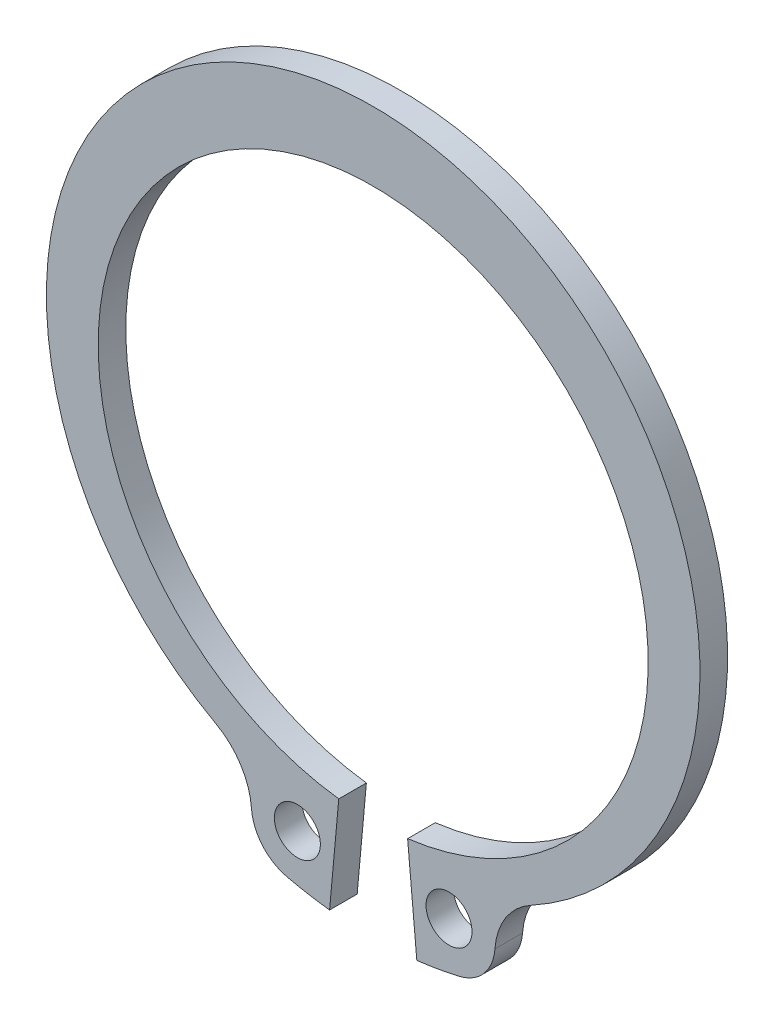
ISO-10303-21;
HEADER;
FILE_DESCRIPTION(('STEP AP214'),'2;1');
FILE_NAME('part.step','',(''),(''),'','','');
FILE_SCHEMA(('AUTOMOTIVE_DESIGN { 1 0 10303 214 1 1 1 1 }'));
ENDSEC;
DATA;
#1=APPLICATION_CONTEXT('core data for automotive mechanical design processes');
#2=APPLICATION_PROTOCOL_DEFINITION('international standard','automotive_design',2000,#1);
#3=PRODUCT_CONTEXT('',#1,'mechanical');
#4=PRODUCT('Part','Part','',(#3));
#5=PRODUCT_RELATED_PRODUCT_CATEGORY('part','',(#4));
#6=PRODUCT_DEFINITION_FORMATION('','',#4);
#7=PRODUCT_DEFINITION_CONTEXT('part definition',#1,'design');
#8=PRODUCT_DEFINITION('design','',#6,#7);
#9=PRODUCT_DEFINITION_SHAPE('','',#8);
#10=(LENGTH_UNIT() NAMED_UNIT(*) SI_UNIT(.MILLI.,.METRE.));
#11=(NAMED_UNIT(*) PLANE_ANGLE_UNIT() SI_UNIT($,.RADIAN.));
#12=(NAMED_UNIT(*) SI_UNIT($,.STERADIAN.) SOLID_ANGLE_UNIT());
#13=UNCERTAINTY_MEASURE_WITH_UNIT(LENGTH_MEASURE(1.E-05),#10,'distance_accuracy_value','');
#14=(GEOMETRIC_REPRESENTATION_CONTEXT(3) GLOBAL_UNCERTAINTY_ASSIGNED_CONTEXT((#13)) GLOBAL_UNIT_ASSIGNED_CONTEXT((#10,
#11,#12)) REPRESENTATION_CONTEXT('',''));
#15=CARTESIAN_POINT('',(0.,0.,0.));
#16=DIRECTION('',(0.,0.,1.));
#17=DIRECTION('',(1.,0.,0.));
#18=AXIS2_PLACEMENT_3D('',#15,#16,#17);
#19=CARTESIAN_POINT('',(0.,0.,1.2));
#20=DIRECTION('',(0.,0.,1.));
#21=DIRECTION('',(1.,0.,0.));
#22=AXIS2_PLACEMENT_3D('',#19,#20,#21);
#23=PLANE('',#22);
#24=CARTESIAN_POINT('',(-3.29477642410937,-13.9646718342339,1.2));
#25=DIRECTION('',(0.,0.,1.));
#26=DIRECTION('',(-1.,0.,0.));
#27=AXIS2_PLACEMENT_3D('',#24,#25,#26);
#28=CIRCLE('',#27,1.);
#29=CARTESIAN_POINT('',(-4.29477642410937,-13.9646718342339,1.2));
#30=VERTEX_POINT('',#29);
#31=EDGE_CURVE('E144',#30,#30,#28,.T.);
#32=ORIENTED_EDGE('',*,*,#31,.F.);
#33=EDGE_LOOP('',(#32));
#34=FACE_BOUND('',#33,.T.);
#35=CARTESIAN_POINT('',(0.,0.,1.2));
#36=DIRECTION('',(0.,0.,-1.));
#37=DIRECTION('',(1.,0.,0.));
#38=AXIS2_PLACEMENT_3D('',#35,#36,#37);
#39=CIRCLE('',#38,11.95);
#40=CARTESIAN_POINT('',(-1.49570369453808,-11.8560267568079,1.2));
#41=VERTEX_POINT('',#40);
#42=CARTESIAN_POINT('',(1.49570369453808,-11.8560267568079,1.2));
#43=VERTEX_POINT('',#42);
#44=EDGE_CURVE('E159',#41,#43,#39,.T.);
#45=ORIENTED_EDGE('',*,*,#44,.T.);
#46=DIRECTION('',(0.0908774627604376,-0.99586208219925,0.));
#47=VECTOR('',#46,1.);
#48=CARTESIAN_POINT('',(1.49570369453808,-11.8560267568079,1.2));
#49=LINE('',#48,#47);
#50=CARTESIAN_POINT('',(1.895564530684,-16.2378199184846,1.2));
#51=VERTEX_POINT('',#50);
#52=EDGE_CURVE('E97',#43,#51,#49,.T.);
#53=ORIENTED_EDGE('',*,*,#52,.T.);
#54=CARTESIAN_POINT('',(0.,0.,1.2));
#55=DIRECTION('',(0.,0.,1.));
#56=DIRECTION('',(1.,0.,0.));
#57=AXIS2_PLACEMENT_3D('',#54,#55,#56);
#58=CIRCLE('',#57,16.3480873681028);
#59=CARTESIAN_POINT('',(3.75403992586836,-15.9112270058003,1.2));
#60=VERTEX_POINT('',#59);
#61=EDGE_CURVE('E180',#51,#60,#58,.T.);
#62=ORIENTED_EDGE('',*,*,#61,.T.);
#63=CARTESIAN_POINT('',(3.29477642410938,-13.9646718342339,1.2));
#64=DIRECTION('',(0.,0.,1.));
#65=DIRECTION('',(1.,0.,0.));
#66=AXIS2_PLACEMENT_3D('',#63,#64,#65);
#67=CIRCLE('',#66,2.);
#68=CARTESIAN_POINT('',(5.28957963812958,-14.1087556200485,1.2));
#69=VERTEX_POINT('',#68);
#70=EDGE_CURVE('E199',#60,#69,#67,.T.);
#71=ORIENTED_EDGE('',*,*,#70,.T.);
#72=CARTESIAN_POINT('',(8.28178445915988,-14.3248812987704,1.2));
#73=DIRECTION('',(0.,0.,-1.));
#74=DIRECTION('',(1.,0.,0.));
#75=AXIS2_PLACEMENT_3D('',#72,#73,#74);
#76=CIRCLE('',#75,3.);
#77=CARTESIAN_POINT('',(6.83728716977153,-11.695541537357,1.2));
#78=VERTEX_POINT('',#77);
#79=EDGE_CURVE('E196',#69,#78,#76,.T.);
#80=ORIENTED_EDGE('',*,*,#79,.T.);
#81=CARTESIAN_POINT('',(0.,0.75,1.2));
#82=DIRECTION('',(0.,0.,1.));
#83=DIRECTION('',(1.,0.,0.));
#84=AXIS2_PLACEMENT_3D('',#81,#82,#83);
#85=CIRCLE('',#84,14.2);
#86=CARTESIAN_POINT('',(-6.83728716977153,-11.695541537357,1.2));
#87=VERTEX_POINT('',#86);
#88=EDGE_CURVE('E198',#78,#87,#85,.T.);
#89=ORIENTED_EDGE('',*,*,#88,.T.);
#90=CARTESIAN_POINT('',(-8.28178445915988,-14.3248812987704,1.2));
#91=DIRECTION('',(0.,0.,-1.));
#92=DIRECTION('',(-1.,0.,0.));
#93=AXIS2_PLACEMENT_3D('',#90,#91,#92);
#94=CIRCLE('',#93,3.);
#95=CARTESIAN_POINT('',(-5.28957963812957,-14.1087556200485,1.2));
#96=VERTEX_POINT('',#95);
#97=EDGE_CURVE('E122',#87,#96,#94,.T.);
#98=ORIENTED_EDGE('',*,*,#97,.T.);
#99=CARTESIAN_POINT('',(-3.29477642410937,-13.9646718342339,1.2));
#100=DIRECTION('',(0.,0.,1.));
#101=DIRECTION('',(-1.,0.,0.));
#102=AXIS2_PLACEMENT_3D('',#99,#100,#101);
#103=CIRCLE('',#102,2.);
#104=CARTESIAN_POINT('',(-3.75403992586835,-15.9112270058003,1.2));
#105=VERTEX_POINT('',#104);
#106=EDGE_CURVE('E116',#96,#105,#103,.T.);
#107=ORIENTED_EDGE('',*,*,#106,.T.);
#108=CARTESIAN_POINT('',(0.,0.,1.2));
#109=DIRECTION('',(0.,0.,1.));
#110=DIRECTION('',(-1.,0.,0.));
#111=AXIS2_PLACEMENT_3D('',#108,#109,#110);
#112=CIRCLE('',#111,16.3480873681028);
#113=CARTESIAN_POINT('',(-1.895564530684,-16.2378199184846,1.2));
#114=VERTEX_POINT('',#113);
#115=EDGE_CURVE('E120',#105,#114,#112,.T.);
#116=ORIENTED_EDGE('',*,*,#115,.T.);
#117=DIRECTION('',(0.0908774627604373,0.99586208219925,0.));
#118=VECTOR('',#117,1.);
#119=CARTESIAN_POINT('',(-1.49570369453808,-11.8560267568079,1.2));
#120=LINE('',#119,#118);
#121=EDGE_CURVE('E48',#114,#41,#120,.T.);
#122=ORIENTED_EDGE('',*,*,#121,.T.);
#123=EDGE_LOOP('',(#45,#53,#62,#71,#80,#89,#98,#107,#116,#122));
#124=FACE_BOUND('',#123,.T.);
#125=CARTESIAN_POINT('',(3.29477642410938,-13.9646718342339,1.2));
#126=DIRECTION('',(0.,0.,1.));
#127=DIRECTION('',(1.,0.,0.));
#128=AXIS2_PLACEMENT_3D('',#125,#126,#127);
#129=CIRCLE('',#128,1.);
#130=CARTESIAN_POINT('',(4.29477642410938,-13.9646718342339,1.2));
#131=VERTEX_POINT('',#130);
#132=EDGE_CURVE('E210',#131,#131,#129,.T.);
#133=ORIENTED_EDGE('',*,*,#132,.F.);
#134=EDGE_LOOP('',(#133));
#135=FACE_BOUND('',#134,.T.);
#136=ADVANCED_FACE('F31',(#34,#124,#135),#23,.T.);
#137=CARTESIAN_POINT('',(0.,0.,0.));
#138=DIRECTION('',(0.,0.,1.));
#139=DIRECTION('',(1.,0.,0.));
#140=AXIS2_PLACEMENT_3D('',#137,#138,#139);
#141=PLANE('',#140);
#142=CARTESIAN_POINT('',(-3.29477642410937,-13.9646718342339,0.));
#143=DIRECTION('',(0.,0.,1.));
#144=DIRECTION('',(-1.,0.,0.));
#145=AXIS2_PLACEMENT_3D('',#142,#143,#144);
#146=CIRCLE('',#145,1.);
#147=CARTESIAN_POINT('',(-4.29477642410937,-13.9646718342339,0.));
#148=VERTEX_POINT('',#147);
#149=EDGE_CURVE('E207',#148,#148,#146,.T.);
#150=ORIENTED_EDGE('',*,*,#149,.T.);
#151=EDGE_LOOP('',(#150));
#152=FACE_BOUND('',#151,.T.);
#153=CARTESIAN_POINT('',(0.,0.,0.));
#154=DIRECTION('',(0.,0.,-1.));
#155=DIRECTION('',(1.,0.,0.));
#156=AXIS2_PLACEMENT_3D('',#153,#154,#155);
#157=CIRCLE('',#156,11.95);
#158=CARTESIAN_POINT('',(-1.49570369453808,-11.8560267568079,0.));
#159=VERTEX_POINT('',#158);
#160=CARTESIAN_POINT('',(1.49570369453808,-11.8560267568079,0.));
#161=VERTEX_POINT('',#160);
#162=EDGE_CURVE('E140',#159,#161,#157,.T.);
#163=ORIENTED_EDGE('',*,*,#162,.F.);
#164=DIRECTION('',(0.0908774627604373,0.99586208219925,0.));
#165=VECTOR('',#164,1.);
#166=CARTESIAN_POINT('',(-1.49570369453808,-11.8560267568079,0.));
#167=LINE('',#166,#165);
#168=CARTESIAN_POINT('',(-1.895564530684,-16.2378199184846,0.));
#169=VERTEX_POINT('',#168);
#170=EDGE_CURVE('E89',#169,#159,#167,.T.);
#171=ORIENTED_EDGE('',*,*,#170,.F.);
#172=CARTESIAN_POINT('',(0.,0.,0.));
#173=DIRECTION('',(0.,0.,1.));
#174=DIRECTION('',(-1.,0.,0.));
#175=AXIS2_PLACEMENT_3D('',#172,#173,#174);
#176=CIRCLE('',#175,16.3480873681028);
#177=CARTESIAN_POINT('',(-3.75403992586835,-15.9112270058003,0.));
#178=VERTEX_POINT('',#177);
#179=EDGE_CURVE('E83',#178,#169,#176,.T.);
#180=ORIENTED_EDGE('',*,*,#179,.F.);
#181=CARTESIAN_POINT('',(-3.29477642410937,-13.9646718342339,0.));
#182=DIRECTION('',(0.,0.,1.));
#183=DIRECTION('',(-1.,0.,0.));
#184=AXIS2_PLACEMENT_3D('',#181,#182,#183);
#185=CIRCLE('',#184,2.);
#186=CARTESIAN_POINT('',(-5.28957963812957,-14.1087556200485,0.));
#187=VERTEX_POINT('',#186);
#188=EDGE_CURVE('E130',#187,#178,#185,.T.);
#189=ORIENTED_EDGE('',*,*,#188,.F.);
#190=CARTESIAN_POINT('',(-8.28178445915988,-14.3248812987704,0.));
#191=DIRECTION('',(0.,0.,-1.));
#192=DIRECTION('',(-1.,0.,0.));
#193=AXIS2_PLACEMENT_3D('',#190,#191,#192);
#194=CIRCLE('',#193,3.);
#195=CARTESIAN_POINT('',(-6.83728716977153,-11.695541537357,0.));
#196=VERTEX_POINT('',#195);
#197=EDGE_CURVE('E154',#196,#187,#194,.T.);
#198=ORIENTED_EDGE('',*,*,#197,.F.);
#199=CARTESIAN_POINT('',(0.,0.75,0.));
#200=DIRECTION('',(0.,0.,1.));
#201=DIRECTION('',(1.,0.,0.));
#202=AXIS2_PLACEMENT_3D('',#199,#200,#201);
#203=CIRCLE('',#202,14.2);
#204=CARTESIAN_POINT('',(6.83728716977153,-11.695541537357,0.));
#205=VERTEX_POINT('',#204);
#206=EDGE_CURVE('E152',#205,#196,#203,.T.);
#207=ORIENTED_EDGE('',*,*,#206,.F.);
#208=CARTESIAN_POINT('',(8.28178445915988,-14.3248812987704,0.));
#209=DIRECTION('',(0.,0.,-1.));
#210=DIRECTION('',(1.,0.,0.));
#211=AXIS2_PLACEMENT_3D('',#208,#209,#210);
#212=CIRCLE('',#211,3.);
#213=CARTESIAN_POINT('',(5.28957963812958,-14.1087556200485,0.));
#214=VERTEX_POINT('',#213);
#215=EDGE_CURVE('E150',#214,#205,#212,.T.);
#216=ORIENTED_EDGE('',*,*,#215,.F.);
#217=CARTESIAN_POINT('',(3.29477642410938,-13.9646718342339,0.));
#218=DIRECTION('',(0.,0.,1.));
#219=DIRECTION('',(1.,0.,0.));
#220=AXIS2_PLACEMENT_3D('',#217,#218,#219);
#221=CIRCLE('',#220,2.);
#222=CARTESIAN_POINT('',(3.75403992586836,-15.9112270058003,0.));
#223=VERTEX_POINT('',#222);
#224=EDGE_CURVE('E148',#223,#214,#221,.T.);
#225=ORIENTED_EDGE('',*,*,#224,.F.);
#226=CARTESIAN_POINT('',(0.,0.,0.));
#227=DIRECTION('',(0.,0.,1.));
#228=DIRECTION('',(1.,0.,0.));
#229=AXIS2_PLACEMENT_3D('',#226,#227,#228);
#230=CIRCLE('',#229,16.3480873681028);
#231=CARTESIAN_POINT('',(1.895564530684,-16.2378199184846,0.));
#232=VERTEX_POINT('',#231);
#233=EDGE_CURVE('E146',#232,#223,#230,.T.);
#234=ORIENTED_EDGE('',*,*,#233,.F.);
#235=DIRECTION('',(0.0908774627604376,-0.99586208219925,0.));
#236=VECTOR('',#235,1.);
#237=CARTESIAN_POINT('',(1.49570369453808,-11.8560267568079,0.));
#238=LINE('',#237,#236);
#239=EDGE_CURVE('E143',#161,#232,#238,.T.);
#240=ORIENTED_EDGE('',*,*,#239,.F.);
#241=EDGE_LOOP('',(#163,#171,#180,#189,#198,#207,#216,#225,#234,#240));
#242=FACE_BOUND('',#241,.T.);
#243=CARTESIAN_POINT('',(3.29477642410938,-13.9646718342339,0.));
#244=DIRECTION('',(0.,0.,1.));
#245=DIRECTION('',(1.,0.,0.));
#246=AXIS2_PLACEMENT_3D('',#243,#244,#245);
#247=CIRCLE('',#246,1.);
#248=CARTESIAN_POINT('',(4.29477642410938,-13.9646718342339,0.));
#249=VERTEX_POINT('',#248);
#250=EDGE_CURVE('E213',#249,#249,#247,.T.);
#251=ORIENTED_EDGE('',*,*,#250,.T.);
#252=EDGE_LOOP('',(#251));
#253=FACE_BOUND('',#252,.T.);
#254=ADVANCED_FACE('F184',(#152,#242,#253),#141,.F.);
#255=CARTESIAN_POINT('',(0.,0.,1.2));
#256=DIRECTION('',(0.,0.,-1.));
#257=DIRECTION('',(-1.,0.,0.));
#258=AXIS2_PLACEMENT_3D('',#255,#256,#257);
#259=CYLINDRICAL_SURFACE('',#258,11.95);
#260=ORIENTED_EDGE('',*,*,#162,.T.);
#261=DIRECTION('',(0.,0.,-1.));
#262=VECTOR('',#261,1.);
#263=CARTESIAN_POINT('',(1.49570369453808,-11.8560267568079,1.2));
#264=LINE('',#263,#262);
#265=EDGE_CURVE('E11',#43,#161,#264,.T.);
#266=ORIENTED_EDGE('',*,*,#265,.F.);
#267=ORIENTED_EDGE('',*,*,#44,.F.);
#268=DIRECTION('',(0.,0.,-1.));
#269=VECTOR('',#268,1.);
#270=CARTESIAN_POINT('',(-1.49570369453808,-11.8560267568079,1.2));
#271=LINE('',#270,#269);
#272=EDGE_CURVE('E136',#41,#159,#271,.T.);
#273=ORIENTED_EDGE('',*,*,#272,.T.);
#274=EDGE_LOOP('',(#260,#266,#267,#273));
#275=FACE_BOUND('',#274,.T.);
#276=ADVANCED_FACE('F33',(#275),#259,.F.);
#277=CARTESIAN_POINT('',(1.49570369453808,-11.8560267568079,1.2));
#278=DIRECTION('',(0.99586208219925,0.0908774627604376,0.));
#279=DIRECTION('',(-0.0908774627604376,0.99586208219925,0.));
#280=AXIS2_PLACEMENT_3D('',#277,#278,#279);
#281=PLANE('',#280);
#282=ORIENTED_EDGE('',*,*,#239,.T.);
#283=DIRECTION('',(0.,0.,-1.));
#284=VECTOR('',#283,1.);
#285=CARTESIAN_POINT('',(1.895564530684,-16.2378199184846,1.2));
#286=LINE('',#285,#284);
#287=EDGE_CURVE('E40',#51,#232,#286,.T.);
#288=ORIENTED_EDGE('',*,*,#287,.F.);
#289=ORIENTED_EDGE('',*,*,#52,.F.);
#290=ORIENTED_EDGE('',*,*,#265,.T.);
#291=EDGE_LOOP('',(#282,#288,#289,#290));
#292=FACE_BOUND('',#291,.T.);
#293=ADVANCED_FACE('F254',(#292),#281,.F.);
#294=CARTESIAN_POINT('',(0.,0.,1.2));
#295=DIRECTION('',(0.,0.,-1.));
#296=DIRECTION('',(-1.,0.,0.));
#297=AXIS2_PLACEMENT_3D('',#294,#295,#296);
#298=CYLINDRICAL_SURFACE('',#297,16.3480873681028);
#299=ORIENTED_EDGE('',*,*,#233,.T.);
#300=DIRECTION('',(0.,0.,-1.));
#301=VECTOR('',#300,1.);
#302=CARTESIAN_POINT('',(3.75403992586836,-15.9112270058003,1.2));
#303=LINE('',#302,#301);
#304=EDGE_CURVE('E172',#60,#223,#303,.T.);
#305=ORIENTED_EDGE('',*,*,#304,.F.);
#306=ORIENTED_EDGE('',*,*,#61,.F.);
#307=ORIENTED_EDGE('',*,*,#287,.T.);
#308=EDGE_LOOP('',(#299,#305,#306,#307));
#309=FACE_BOUND('',#308,.T.);
#310=ADVANCED_FACE('F178',(#309),#298,.T.);
#311=CARTESIAN_POINT('',(3.29477642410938,-13.9646718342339,1.2));
#312=DIRECTION('',(0.,0.,-1.));
#313=DIRECTION('',(-1.,0.,0.));
#314=AXIS2_PLACEMENT_3D('',#311,#312,#313);
#315=CYLINDRICAL_SURFACE('',#314,2.);
#316=ORIENTED_EDGE('',*,*,#224,.T.);
#317=DIRECTION('',(0.,0.,-1.));
#318=VECTOR('',#317,1.);
#319=CARTESIAN_POINT('',(5.28957963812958,-14.1087556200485,1.2));
#320=LINE('',#319,#318);
#321=EDGE_CURVE('E169',#69,#214,#320,.T.);
#322=ORIENTED_EDGE('',*,*,#321,.F.);
#323=ORIENTED_EDGE('',*,*,#70,.F.);
#324=ORIENTED_EDGE('',*,*,#304,.T.);
#325=EDGE_LOOP('',(#316,#322,#323,#324));
#326=FACE_BOUND('',#325,.T.);
#327=ADVANCED_FACE('F190',(#326),#315,.T.);
#328=CARTESIAN_POINT('',(8.28178445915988,-14.3248812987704,1.2));
#329=DIRECTION('',(0.,0.,-1.));
#330=DIRECTION('',(-1.,0.,0.));
#331=AXIS2_PLACEMENT_3D('',#328,#329,#330);
#332=CYLINDRICAL_SURFACE('',#331,3.);
#333=ORIENTED_EDGE('',*,*,#215,.T.);
#334=DIRECTION('',(0.,0.,-1.));
#335=VECTOR('',#334,1.);
#336=CARTESIAN_POINT('',(6.83728716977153,-11.695541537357,1.2));
#337=LINE('',#336,#335);
#338=EDGE_CURVE('E166',#78,#205,#337,.T.);
#339=ORIENTED_EDGE('',*,*,#338,.F.);
#340=ORIENTED_EDGE('',*,*,#79,.F.);
#341=ORIENTED_EDGE('',*,*,#321,.T.);
#342=EDGE_LOOP('',(#333,#339,#340,#341));
#343=FACE_BOUND('',#342,.T.);
#344=ADVANCED_FACE('F194',(#343),#332,.F.);
#345=CARTESIAN_POINT('',(0.,0.75,1.2));
#346=DIRECTION('',(0.,0.,-1.));
#347=DIRECTION('',(-1.,0.,0.));
#348=AXIS2_PLACEMENT_3D('',#345,#346,#347);
#349=CYLINDRICAL_SURFACE('',#348,14.2);
#350=ORIENTED_EDGE('',*,*,#206,.T.);
#351=DIRECTION('',(0.,0.,-1.));
#352=VECTOR('',#351,1.);
#353=CARTESIAN_POINT('',(-6.83728716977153,-11.695541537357,1.2));
#354=LINE('',#353,#352);
#355=EDGE_CURVE('E163',#87,#196,#354,.T.);
#356=ORIENTED_EDGE('',*,*,#355,.F.);
#357=ORIENTED_EDGE('',*,*,#88,.F.);
#358=ORIENTED_EDGE('',*,*,#338,.T.);
#359=EDGE_LOOP('',(#350,#356,#357,#358));
#360=FACE_BOUND('',#359,.T.);
#361=ADVANCED_FACE('F244',(#360),#349,.T.);
#362=CARTESIAN_POINT('',(-8.28178445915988,-14.3248812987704,1.2));
#363=DIRECTION('',(0.,0.,-1.));
#364=DIRECTION('',(-1.,0.,0.));
#365=AXIS2_PLACEMENT_3D('',#362,#363,#364);
#366=CYLINDRICAL_SURFACE('',#365,3.);
#367=ORIENTED_EDGE('',*,*,#197,.T.);
#368=DIRECTION('',(0.,0.,-1.));
#369=VECTOR('',#368,1.);
#370=CARTESIAN_POINT('',(-5.28957963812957,-14.1087556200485,1.2));
#371=LINE('',#370,#369);
#372=EDGE_CURVE('E131',#96,#187,#371,.T.);
#373=ORIENTED_EDGE('',*,*,#372,.F.);
#374=ORIENTED_EDGE('',*,*,#97,.F.);
#375=ORIENTED_EDGE('',*,*,#355,.T.);
#376=EDGE_LOOP('',(#367,#373,#374,#375));
#377=FACE_BOUND('',#376,.T.);
#378=ADVANCED_FACE('F241',(#377),#366,.F.);
#379=CARTESIAN_POINT('',(-3.29477642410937,-13.9646718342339,1.2));
#380=DIRECTION('',(0.,0.,-1.));
#381=DIRECTION('',(-1.,0.,0.));
#382=AXIS2_PLACEMENT_3D('',#379,#380,#381);
#383=CYLINDRICAL_SURFACE('',#382,2.);
#384=ORIENTED_EDGE('',*,*,#188,.T.);
#385=DIRECTION('',(0.,0.,-1.));
#386=VECTOR('',#385,1.);
#387=CARTESIAN_POINT('',(-3.75403992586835,-15.9112270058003,1.2));
#388=LINE('',#387,#386);
#389=EDGE_CURVE('E127',#105,#178,#388,.T.);
#390=ORIENTED_EDGE('',*,*,#389,.F.);
#391=ORIENTED_EDGE('',*,*,#106,.F.);
#392=ORIENTED_EDGE('',*,*,#372,.T.);
#393=EDGE_LOOP('',(#384,#390,#391,#392));
#394=FACE_BOUND('',#393,.T.);
#395=ADVANCED_FACE('F128',(#394),#383,.T.);
#396=CARTESIAN_POINT('',(0.,0.,1.2));
#397=DIRECTION('',(0.,0.,-1.));
#398=DIRECTION('',(-1.,0.,0.));
#399=AXIS2_PLACEMENT_3D('',#396,#397,#398);
#400=CYLINDRICAL_SURFACE('',#399,16.3480873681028);
#401=ORIENTED_EDGE('',*,*,#179,.T.);
#402=DIRECTION('',(0.,0.,-1.));
#403=VECTOR('',#402,1.);
#404=CARTESIAN_POINT('',(-1.895564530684,-16.2378199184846,1.2));
#405=LINE('',#404,#403);
#406=EDGE_CURVE('E132',#114,#169,#405,.T.);
#407=ORIENTED_EDGE('',*,*,#406,.F.);
#408=ORIENTED_EDGE('',*,*,#115,.F.);
#409=ORIENTED_EDGE('',*,*,#389,.T.);
#410=EDGE_LOOP('',(#401,#407,#408,#409));
#411=FACE_BOUND('',#410,.T.);
#412=ADVANCED_FACE('F134',(#411),#400,.T.);
#413=CARTESIAN_POINT('',(-1.49570369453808,-11.8560267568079,1.2));
#414=DIRECTION('',(-0.99586208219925,0.0908774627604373,0.));
#415=DIRECTION('',(-0.0908774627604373,-0.99586208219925,0.));
#416=AXIS2_PLACEMENT_3D('',#413,#414,#415);
#417=PLANE('',#416);
#418=ORIENTED_EDGE('',*,*,#170,.T.);
#419=ORIENTED_EDGE('',*,*,#272,.F.);
#420=ORIENTED_EDGE('',*,*,#121,.F.);
#421=ORIENTED_EDGE('',*,*,#406,.T.);
#422=EDGE_LOOP('',(#418,#419,#420,#421));
#423=FACE_BOUND('',#422,.T.);
#424=ADVANCED_FACE('F234',(#423),#417,.F.);
#425=CARTESIAN_POINT('',(-3.29477642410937,-13.9646718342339,1.2));
#426=DIRECTION('',(0.,0.,-1.));
#427=DIRECTION('',(-1.,0.,0.));
#428=AXIS2_PLACEMENT_3D('',#425,#426,#427);
#429=CYLINDRICAL_SURFACE('',#428,1.);
#430=ORIENTED_EDGE('',*,*,#31,.T.);
#431=EDGE_LOOP('',(#430));
#432=FACE_BOUND('',#431,.T.);
#433=ORIENTED_EDGE('',*,*,#149,.F.);
#434=EDGE_LOOP('',(#433));
#435=FACE_BOUND('',#434,.T.);
#436=ADVANCED_FACE('F231',(#432,#435),#429,.F.);
#437=CARTESIAN_POINT('',(3.29477642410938,-13.9646718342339,1.2));
#438=DIRECTION('',(0.,0.,-1.));
#439=DIRECTION('',(-1.,0.,0.));
#440=AXIS2_PLACEMENT_3D('',#437,#438,#439);
#441=CYLINDRICAL_SURFACE('',#440,1.);
#442=ORIENTED_EDGE('',*,*,#132,.T.);
#443=EDGE_LOOP('',(#442));
#444=FACE_BOUND('',#443,.T.);
#445=ORIENTED_EDGE('',*,*,#250,.F.);
#446=EDGE_LOOP('',(#445));
#447=FACE_BOUND('',#446,.T.);
#448=ADVANCED_FACE('F219',(#444,#447),#441,.F.);
#449=CLOSED_SHELL('',(#136,#254,#276,#293,#310,#327,#344,#361,#378,#395,#412,#424,#436,#448));
#450=MANIFOLD_SOLID_BREP('B2',#449);
#451=ADVANCED_BREP_SHAPE_REPRESENTATION('',(#18,#450),#14);
#452=SHAPE_DEFINITION_REPRESENTATION(#9,#451);
ENDSEC;
END-ISO-10303-21;
